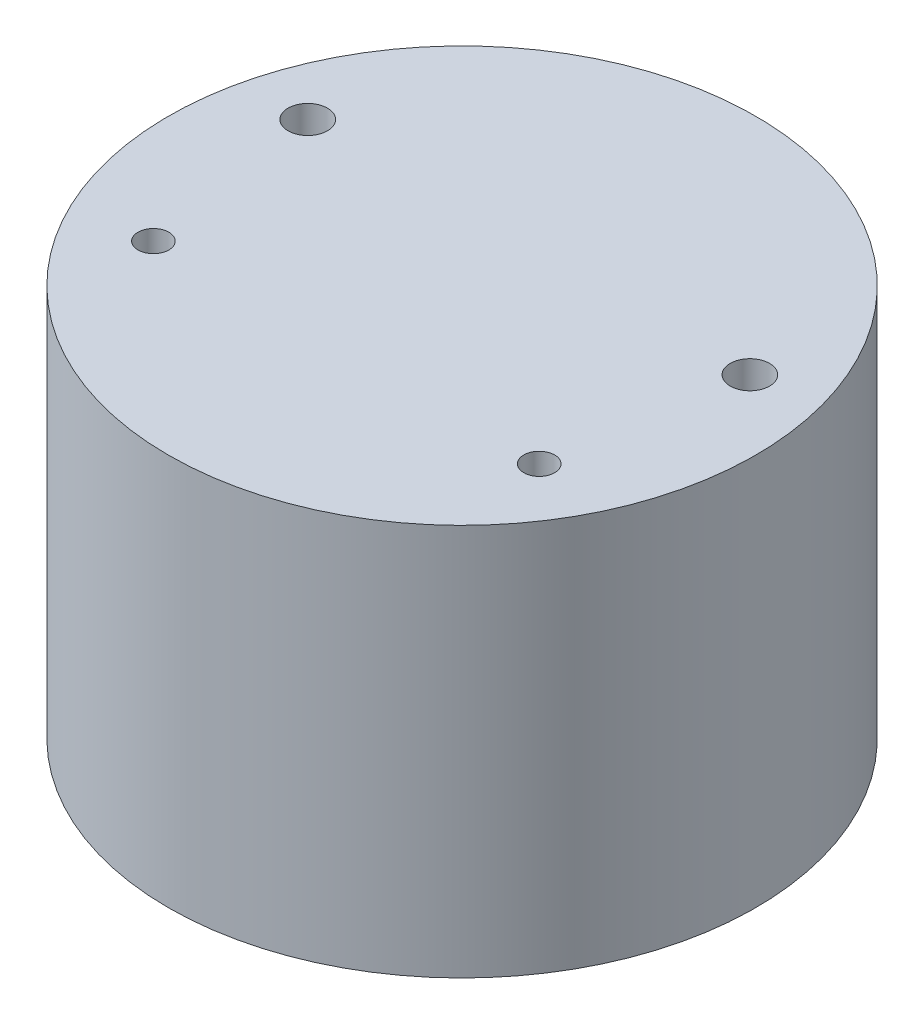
from build123d import *

# Parameters (mm, degrees)
SKETCH1_R                   = 38.05
BOSS_EXTRUDE1_DEPTH         = 50.8
F_1_4_20_TAPPED_HOLE1_D     = 5.1054
F_1_4_20_TAPPED_HOLE1_DEPTH = 16.51
F_1_4_20_TAPPED_HOLE1_TIP   = 1.533816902
SKETCH4_R                   = 2
CUT_EXTRUDE1_DEPTH          = 10


with BuildPart() as part:
    # Sketch1 → Boss-Extrude1 (new body)
    with BuildSketch(Plane(origin=(0, 0, 0), x_dir=(1, 0, 0), z_dir=(0, 1, 0))):
        with Locations(Location((0, 0, 0), (0, 0, 270))):
            Circle(SKETCH1_R)
    extrude(amount=BOSS_EXTRUDE1_DEPTH)

    # 1_4-20 Tapped Hole1
    with Locations(Plane(origin=(0, 50.8, 0), x_dir=(-1, 0, 0), z_dir=(0, 1, 0))):
        with Locations((28.65, -8.65), (-28.65, -8.65)):
            Hole(F_1_4_20_TAPPED_HOLE1_D / 2, depth=F_1_4_20_TAPPED_HOLE1_DEPTH)
            with Locations((0, 0, -(F_1_4_20_TAPPED_HOLE1_DEPTH + F_1_4_20_TAPPED_HOLE1_TIP / 2))):  # 118° drill point
                Cone(0, F_1_4_20_TAPPED_HOLE1_D / 2, F_1_4_20_TAPPED_HOLE1_TIP, mode=Mode.SUBTRACT)

    # Sketch4 → Cut-Extrude1 (cut)
    with BuildSketch(Plane(origin=(0, 50.8, 0), x_dir=(1, 0, 0), z_dir=(0, 1, 0))):
        with Locations(Location((25, -15, 0), (0, 0, 270))):
            Circle(SKETCH4_R)
        with Locations(Location((-25, -15, 0), (0, 0, 270))):
            Circle(SKETCH4_R)
    extrude(amount=-CUT_EXTRUDE1_DEPTH, mode=Mode.SUBTRACT)


solid = part.part
